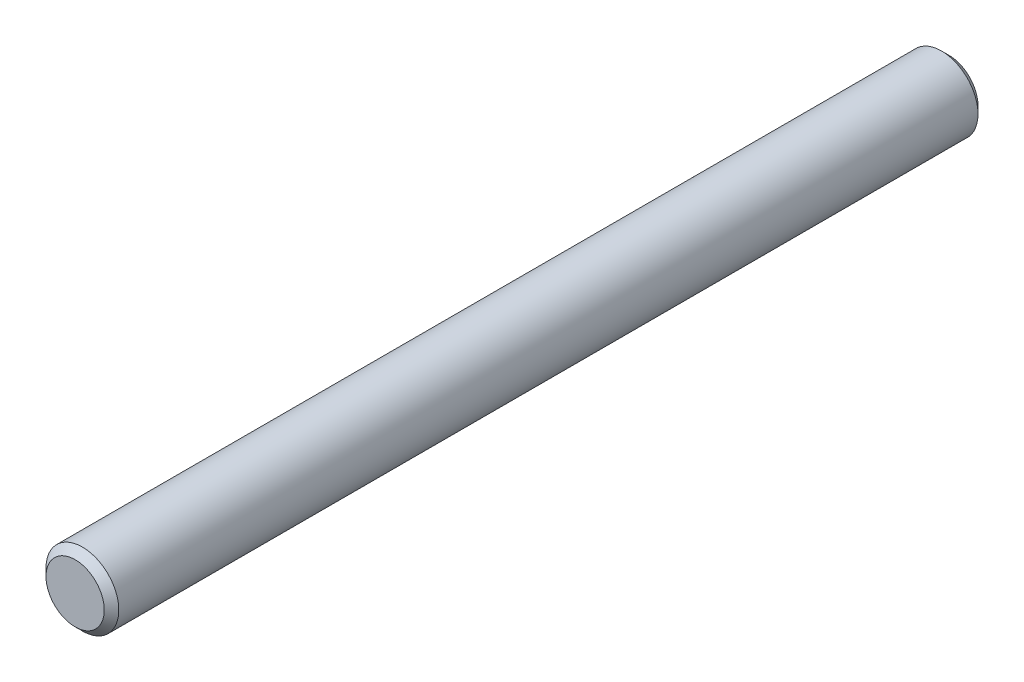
from build123d import *

# Parameters (mm, degrees)
SKETCH1_R      = 3.175
EXTRUDE1_DEPTH = 38.1
CHAMFER1_SIZE  = 0.635


with BuildPart() as part:
    # Sketch1 → Extrude1 (new, symmetric)
    with BuildSketch(Plane.XY):
        with Locations(Location((0, 0, 0), (0, 0, 180))):
            Circle(SKETCH1_R)
    extrude(amount=EXTRUDE1_DEPTH, both=True)

    # Chamfer1
    chamfer1_edges = [part.edges().sort_by_distance(p)[0] for p in [
        (3.175, 0, -38.1),
        (3.175, 0, 38.1),
    ]]
    chamfer(chamfer1_edges, length=CHAMFER1_SIZE)


solid = part.part
